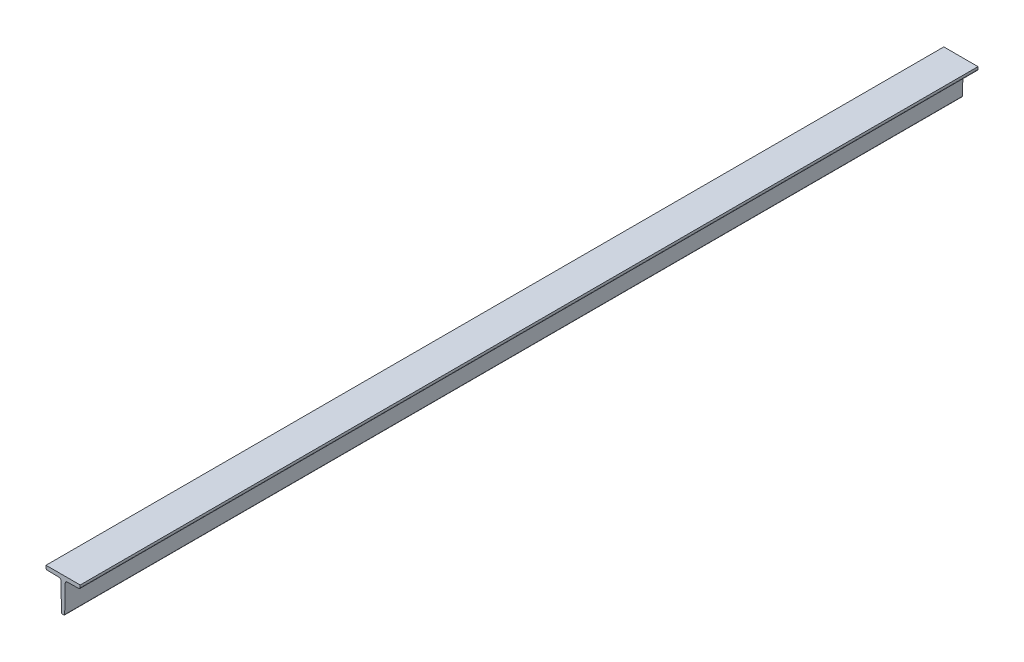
ISO-10303-21;
HEADER;
FILE_DESCRIPTION(('STEP AP214'),'2;1');
FILE_NAME('part.step','',(''),(''),'','','');
FILE_SCHEMA(('AUTOMOTIVE_DESIGN { 1 0 10303 214 1 1 1 1 }'));
ENDSEC;
DATA;
#1=APPLICATION_CONTEXT('core data for automotive mechanical design processes');
#2=APPLICATION_PROTOCOL_DEFINITION('international standard','automotive_design',2000,#1);
#3=PRODUCT_CONTEXT('',#1,'mechanical');
#4=PRODUCT('Part','Part','',(#3));
#5=PRODUCT_RELATED_PRODUCT_CATEGORY('part','',(#4));
#6=PRODUCT_DEFINITION_FORMATION('','',#4);
#7=PRODUCT_DEFINITION_CONTEXT('part definition',#1,'design');
#8=PRODUCT_DEFINITION('design','',#6,#7);
#9=PRODUCT_DEFINITION_SHAPE('','',#8);
#10=(LENGTH_UNIT() NAMED_UNIT(*) SI_UNIT(.MILLI.,.METRE.));
#11=(NAMED_UNIT(*) PLANE_ANGLE_UNIT() SI_UNIT($,.RADIAN.));
#12=(NAMED_UNIT(*) SI_UNIT($,.STERADIAN.) SOLID_ANGLE_UNIT());
#13=UNCERTAINTY_MEASURE_WITH_UNIT(LENGTH_MEASURE(1.E-05),#10,'distance_accuracy_value','');
#14=(GEOMETRIC_REPRESENTATION_CONTEXT(3) GLOBAL_UNCERTAINTY_ASSIGNED_CONTEXT((#13)) GLOBAL_UNIT_ASSIGNED_CONTEXT((#10,
#11,#12)) REPRESENTATION_CONTEXT('',''));
#15=CARTESIAN_POINT('',(0.,0.,0.));
#16=DIRECTION('',(0.,0.,1.));
#17=DIRECTION('',(1.,0.,0.));
#18=AXIS2_PLACEMENT_3D('',#15,#16,#17);
#19=CARTESIAN_POINT('',(-40.,0.,1051.));
#20=DIRECTION('',(1.,0.,0.));
#21=DIRECTION('',(0.,1.,0.));
#22=AXIS2_PLACEMENT_3D('',#19,#20,#21);
#23=PLANE('',#22);
#24=DIRECTION('',(0.,-1.,0.));
#25=VECTOR('',#24,1.);
#26=CARTESIAN_POINT('',(-40.,0.,-1051.));
#27=LINE('',#26,#25);
#28=CARTESIAN_POINT('',(-40.,0.,-1051.));
#29=VERTEX_POINT('',#28);
#30=CARTESIAN_POINT('',(-40.,-5.487795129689,-1051.));
#31=VERTEX_POINT('',#30);
#32=EDGE_CURVE('E137',#29,#31,#27,.T.);
#33=ORIENTED_EDGE('',*,*,#32,.T.);
#34=DIRECTION('',(0.,0.,-1.));
#35=VECTOR('',#34,1.);
#36=CARTESIAN_POINT('',(-40.,-5.487795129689,1051.));
#37=LINE('',#36,#35);
#38=CARTESIAN_POINT('',(-40.,-5.487795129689,1051.));
#39=VERTEX_POINT('',#38);
#40=EDGE_CURVE('E11',#39,#31,#37,.T.);
#41=ORIENTED_EDGE('',*,*,#40,.F.);
#42=DIRECTION('',(0.,-1.,0.));
#43=VECTOR('',#42,1.);
#44=CARTESIAN_POINT('',(-40.,0.,1051.));
#45=LINE('',#44,#43);
#46=CARTESIAN_POINT('',(-40.,0.,1051.));
#47=VERTEX_POINT('',#46);
#48=EDGE_CURVE('E176',#47,#39,#45,.T.);
#49=ORIENTED_EDGE('',*,*,#48,.F.);
#50=DIRECTION('',(0.,0.,-1.));
#51=VECTOR('',#50,1.);
#52=CARTESIAN_POINT('',(-40.,0.,1051.));
#53=LINE('',#52,#51);
#54=EDGE_CURVE('E150',#47,#29,#53,.T.);
#55=ORIENTED_EDGE('',*,*,#54,.T.);
#56=EDGE_LOOP('',(#33,#41,#49,#55));
#57=FACE_BOUND('',#56,.T.);
#58=ADVANCED_FACE('F33',(#57),#23,.F.);
#59=CARTESIAN_POINT('',(-36.825,-5.487795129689,1051.));
#60=DIRECTION('',(0.,0.,-1.));
#61=DIRECTION('',(-1.,0.,0.));
#62=AXIS2_PLACEMENT_3D('',#59,#60,#61);
#63=CYLINDRICAL_SURFACE('',#62,3.175);
#64=CARTESIAN_POINT('',(-36.825,-5.487795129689,-1051.));
#65=DIRECTION('',(0.,0.,1.));
#66=DIRECTION('',(-1.,0.,0.));
#67=AXIS2_PLACEMENT_3D('',#64,#65,#66);
#68=CIRCLE('',#67,3.175);
#69=CARTESIAN_POINT('',(-36.8885004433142,-8.66216005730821,-1051.));
#70=VERTEX_POINT('',#69);
#71=EDGE_CURVE('E133',#31,#70,#68,.T.);
#72=ORIENTED_EDGE('',*,*,#71,.T.);
#73=DIRECTION('',(0.,0.,-1.));
#74=VECTOR('',#73,1.);
#75=CARTESIAN_POINT('',(-36.8885004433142,-8.66216005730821,1051.));
#76=LINE('',#75,#74);
#77=CARTESIAN_POINT('',(-36.8885004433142,-8.66216005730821,1051.));
#78=VERTEX_POINT('',#77);
#79=EDGE_CURVE('E40',#78,#70,#76,.T.);
#80=ORIENTED_EDGE('',*,*,#79,.F.);
#81=CARTESIAN_POINT('',(-36.825,-5.487795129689,1051.));
#82=DIRECTION('',(0.,0.,1.));
#83=DIRECTION('',(-1.,0.,0.));
#84=AXIS2_PLACEMENT_3D('',#81,#82,#83);
#85=CIRCLE('',#84,3.175);
#86=EDGE_CURVE('E146',#39,#78,#85,.T.);
#87=ORIENTED_EDGE('',*,*,#86,.F.);
#88=ORIENTED_EDGE('',*,*,#40,.T.);
#89=EDGE_LOOP('',(#72,#80,#87,#88));
#90=FACE_BOUND('',#89,.T.);
#91=ADVANCED_FACE('F145',(#90),#63,.T.);
#92=CARTESIAN_POINT('',(-9.4368003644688,-9.21130773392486,1051.));
#93=DIRECTION('',(0.0200001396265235,0.9997999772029,0.));
#94=DIRECTION('',(-0.9997999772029,0.0200001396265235,0.));
#95=AXIS2_PLACEMENT_3D('',#92,#93,#94);
#96=PLANE('',#95);
#97=DIRECTION('',(0.9997999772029,-0.0200001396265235,0.));
#98=VECTOR('',#97,1.);
#99=CARTESIAN_POINT('',(-9.4368003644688,-9.21130773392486,-1051.));
#100=LINE('',#99,#98);
#101=CARTESIAN_POINT('',(-9.4368003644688,-9.21130773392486,-1051.));
#102=VERTEX_POINT('',#101);
#103=EDGE_CURVE('E139',#70,#102,#100,.T.);
#104=ORIENTED_EDGE('',*,*,#103,.T.);
#105=DIRECTION('',(0.,0.,-1.));
#106=VECTOR('',#105,1.);
#107=CARTESIAN_POINT('',(-9.4368003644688,-9.21130773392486,1051.));
#108=LINE('',#107,#106);
#109=CARTESIAN_POINT('',(-9.4368003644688,-9.21130773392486,1051.));
#110=VERTEX_POINT('',#109);
#111=EDGE_CURVE('E232',#110,#102,#108,.T.);
#112=ORIENTED_EDGE('',*,*,#111,.F.);
#113=DIRECTION('',(0.9997999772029,-0.0200001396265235,0.));
#114=VECTOR('',#113,1.);
#115=CARTESIAN_POINT('',(-9.4368003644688,-9.21130773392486,1051.));
#116=LINE('',#115,#114);
#117=EDGE_CURVE('E179',#78,#110,#116,.T.);
#118=ORIENTED_EDGE('',*,*,#117,.F.);
#119=ORIENTED_EDGE('',*,*,#79,.T.);
#120=EDGE_LOOP('',(#104,#112,#118,#119));
#121=FACE_BOUND('',#120,.T.);
#122=ADVANCED_FACE('F236',(#121),#96,.F.);
#123=CARTESIAN_POINT('',(-9.52680099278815,-13.7104076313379,1051.));
#124=DIRECTION('',(0.,0.,-1.));
#125=DIRECTION('',(-1.,0.,0.));
#126=AXIS2_PLACEMENT_3D('',#123,#124,#125);
#127=CYLINDRICAL_SURFACE('',#126,4.5);
#128=CARTESIAN_POINT('',(-9.52680099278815,-13.7104076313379,-1051.));
#129=DIRECTION('',(0.,0.,-1.));
#130=DIRECTION('',(1.,0.,0.));
#131=AXIS2_PLACEMENT_3D('',#128,#129,#130);
#132=CIRCLE('',#131,4.5);
#133=CARTESIAN_POINT('',(-5.0277010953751,-13.6204070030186,-1051.));
#134=VERTEX_POINT('',#133);
#135=EDGE_CURVE('E154',#102,#134,#132,.T.);
#136=ORIENTED_EDGE('',*,*,#135,.T.);
#137=DIRECTION('',(0.,0.,-1.));
#138=VECTOR('',#137,1.);
#139=CARTESIAN_POINT('',(-5.0277010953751,-13.6204070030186,1051.));
#140=LINE('',#139,#138);
#141=CARTESIAN_POINT('',(-5.0277010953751,-13.6204070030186,1051.));
#142=VERTEX_POINT('',#141);
#143=EDGE_CURVE('E229',#142,#134,#140,.T.);
#144=ORIENTED_EDGE('',*,*,#143,.F.);
#145=CARTESIAN_POINT('',(-9.52680099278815,-13.7104076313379,1051.));
#146=DIRECTION('',(0.,0.,-1.));
#147=DIRECTION('',(1.,0.,0.));
#148=AXIS2_PLACEMENT_3D('',#145,#146,#147);
#149=CIRCLE('',#148,4.5);
#150=EDGE_CURVE('E181',#110,#142,#149,.T.);
#151=ORIENTED_EDGE('',*,*,#150,.F.);
#152=ORIENTED_EDGE('',*,*,#111,.T.);
#153=EDGE_LOOP('',(#136,#144,#151,#152));
#154=FACE_BOUND('',#153,.T.);
#155=ADVANCED_FACE('F244',(#154),#127,.F.);
#156=CARTESIAN_POINT('',(-3.73904247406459,-78.0400002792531,1051.));
#157=DIRECTION('',(0.9997999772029,0.0200001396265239,0.));
#158=DIRECTION('',(-0.0200001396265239,0.9997999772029,0.));
#159=AXIS2_PLACEMENT_3D('',#156,#157,#158);
#160=PLANE('',#159);
#161=DIRECTION('',(0.0200001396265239,-0.9997999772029,0.));
#162=VECTOR('',#161,1.);
#163=CARTESIAN_POINT('',(-3.73904247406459,-78.0400002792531,-1051.));
#164=LINE('',#163,#162);
#165=CARTESIAN_POINT('',(-3.73904247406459,-78.0400002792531,-1051.));
#166=VERTEX_POINT('',#165);
#167=EDGE_CURVE('E156',#134,#166,#164,.T.);
#168=ORIENTED_EDGE('',*,*,#167,.T.);
#169=DIRECTION('',(0.,0.,-1.));
#170=VECTOR('',#169,1.);
#171=CARTESIAN_POINT('',(-3.73904247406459,-78.0400002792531,1051.));
#172=LINE('',#171,#170);
#173=CARTESIAN_POINT('',(-3.73904247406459,-78.0400002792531,1051.));
#174=VERTEX_POINT('',#173);
#175=EDGE_CURVE('E226',#174,#166,#172,.T.);
#176=ORIENTED_EDGE('',*,*,#175,.F.);
#177=DIRECTION('',(0.0200001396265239,-0.9997999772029,0.));
#178=VECTOR('',#177,1.);
#179=CARTESIAN_POINT('',(-3.73904247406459,-78.0400002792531,1051.));
#180=LINE('',#179,#178);
#181=EDGE_CURVE('E183',#142,#174,#180,.T.);
#182=ORIENTED_EDGE('',*,*,#181,.F.);
#183=ORIENTED_EDGE('',*,*,#143,.T.);
#184=EDGE_LOOP('',(#168,#176,#182,#183));
#185=FACE_BOUND('',#184,.T.);
#186=ADVANCED_FACE('F247',(#185),#160,.F.);
#187=CARTESIAN_POINT('',(-1.73944251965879,-78.,1051.));
#188=DIRECTION('',(0.,0.,-1.));
#189=DIRECTION('',(-1.,0.,0.));
#190=AXIS2_PLACEMENT_3D('',#187,#188,#189);
#191=CYLINDRICAL_SURFACE('',#190,2.);
#192=CARTESIAN_POINT('',(-1.73944251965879,-78.,-1051.));
#193=DIRECTION('',(0.,0.,1.));
#194=DIRECTION('',(-1.,0.,0.));
#195=AXIS2_PLACEMENT_3D('',#192,#193,#194);
#196=CIRCLE('',#195,2.);
#197=CARTESIAN_POINT('',(-1.73944251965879,-80.,-1051.));
#198=VERTEX_POINT('',#197);
#199=EDGE_CURVE('E158',#166,#198,#196,.T.);
#200=ORIENTED_EDGE('',*,*,#199,.T.);
#201=DIRECTION('',(0.,0.,-1.));
#202=VECTOR('',#201,1.);
#203=CARTESIAN_POINT('',(-1.73944251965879,-80.,1051.));
#204=LINE('',#203,#202);
#205=CARTESIAN_POINT('',(-1.73944251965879,-80.,1051.));
#206=VERTEX_POINT('',#205);
#207=EDGE_CURVE('E223',#206,#198,#204,.T.);
#208=ORIENTED_EDGE('',*,*,#207,.F.);
#209=CARTESIAN_POINT('',(-1.73944251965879,-78.,1051.));
#210=DIRECTION('',(0.,0.,1.));
#211=DIRECTION('',(-1.,0.,0.));
#212=AXIS2_PLACEMENT_3D('',#209,#210,#211);
#213=CIRCLE('',#212,2.);
#214=EDGE_CURVE('E185',#174,#206,#213,.T.);
#215=ORIENTED_EDGE('',*,*,#214,.F.);
#216=ORIENTED_EDGE('',*,*,#175,.T.);
#217=EDGE_LOOP('',(#200,#208,#215,#216));
#218=FACE_BOUND('',#217,.T.);
#219=ADVANCED_FACE('F252',(#218),#191,.T.);
#220=CARTESIAN_POINT('',(-1.73944251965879,-80.,1051.));
#221=DIRECTION('',(0.,1.,0.));
#222=DIRECTION('',(0.,0.,1.));
#223=AXIS2_PLACEMENT_3D('',#220,#221,#222);
#224=PLANE('',#223);
#225=DIRECTION('',(1.,0.,0.));
#226=VECTOR('',#225,1.);
#227=CARTESIAN_POINT('',(-1.73944251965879,-80.,-1051.));
#228=LINE('',#227,#226);
#229=CARTESIAN_POINT('',(1.73944251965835,-80.,-1051.));
#230=VERTEX_POINT('',#229);
#231=EDGE_CURVE('E160',#198,#230,#228,.T.);
#232=ORIENTED_EDGE('',*,*,#231,.T.);
#233=DIRECTION('',(0.,0.,-1.));
#234=VECTOR('',#233,1.);
#235=CARTESIAN_POINT('',(1.73944251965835,-80.,1051.));
#236=LINE('',#235,#234);
#237=CARTESIAN_POINT('',(1.73944251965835,-80.,1051.));
#238=VERTEX_POINT('',#237);
#239=EDGE_CURVE('E220',#238,#230,#236,.T.);
#240=ORIENTED_EDGE('',*,*,#239,.F.);
#241=DIRECTION('',(1.,0.,0.));
#242=VECTOR('',#241,1.);
#243=CARTESIAN_POINT('',(-1.73944251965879,-80.,1051.));
#244=LINE('',#243,#242);
#245=EDGE_CURVE('E187',#206,#238,#244,.T.);
#246=ORIENTED_EDGE('',*,*,#245,.F.);
#247=ORIENTED_EDGE('',*,*,#207,.T.);
#248=EDGE_LOOP('',(#232,#240,#246,#247));
#249=FACE_BOUND('',#248,.T.);
#250=ADVANCED_FACE('F258',(#249),#224,.F.);
#251=CARTESIAN_POINT('',(1.73944251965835,-78.,1051.));
#252=DIRECTION('',(0.,0.,-1.));
#253=DIRECTION('',(-1.,0.,0.));
#254=AXIS2_PLACEMENT_3D('',#251,#252,#253);
#255=CYLINDRICAL_SURFACE('',#254,2.);
#256=CARTESIAN_POINT('',(1.73944251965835,-78.,-1051.));
#257=DIRECTION('',(0.,0.,1.));
#258=DIRECTION('',(-1.,0.,0.));
#259=AXIS2_PLACEMENT_3D('',#256,#257,#258);
#260=CIRCLE('',#259,2.);
#261=CARTESIAN_POINT('',(3.73904247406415,-78.0400002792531,-1051.));
#262=VERTEX_POINT('',#261);
#263=EDGE_CURVE('E162',#230,#262,#260,.T.);
#264=ORIENTED_EDGE('',*,*,#263,.T.);
#265=DIRECTION('',(0.,0.,-1.));
#266=VECTOR('',#265,1.);
#267=CARTESIAN_POINT('',(3.73904247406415,-78.0400002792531,1051.));
#268=LINE('',#267,#266);
#269=CARTESIAN_POINT('',(3.73904247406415,-78.0400002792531,1051.));
#270=VERTEX_POINT('',#269);
#271=EDGE_CURVE('E217',#270,#262,#268,.T.);
#272=ORIENTED_EDGE('',*,*,#271,.F.);
#273=CARTESIAN_POINT('',(1.73944251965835,-78.,1051.));
#274=DIRECTION('',(0.,0.,1.));
#275=DIRECTION('',(-1.,0.,0.));
#276=AXIS2_PLACEMENT_3D('',#273,#274,#275);
#277=CIRCLE('',#276,2.);
#278=EDGE_CURVE('E189',#238,#270,#277,.T.);
#279=ORIENTED_EDGE('',*,*,#278,.F.);
#280=ORIENTED_EDGE('',*,*,#239,.T.);
#281=EDGE_LOOP('',(#264,#272,#279,#280));
#282=FACE_BOUND('',#281,.T.);
#283=ADVANCED_FACE('F262',(#282),#255,.T.);
#284=CARTESIAN_POINT('',(5.0277010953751,-13.6204070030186,1051.));
#285=DIRECTION('',(-0.9997999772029,0.0200001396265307,0.));
#286=DIRECTION('',(-0.0200001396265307,-0.9997999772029,0.));
#287=AXIS2_PLACEMENT_3D('',#284,#285,#286);
#288=PLANE('',#287);
#289=DIRECTION('',(0.0200001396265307,0.9997999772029,0.));
#290=VECTOR('',#289,1.);
#291=CARTESIAN_POINT('',(5.0277010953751,-13.6204070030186,-1051.));
#292=LINE('',#291,#290);
#293=CARTESIAN_POINT('',(5.0277010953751,-13.6204070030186,-1051.));
#294=VERTEX_POINT('',#293);
#295=EDGE_CURVE('E164',#262,#294,#292,.T.);
#296=ORIENTED_EDGE('',*,*,#295,.T.);
#297=DIRECTION('',(0.,0.,-1.));
#298=VECTOR('',#297,1.);
#299=CARTESIAN_POINT('',(5.0277010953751,-13.6204070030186,1051.));
#300=LINE('',#299,#298);
#301=CARTESIAN_POINT('',(5.0277010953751,-13.6204070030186,1051.));
#302=VERTEX_POINT('',#301);
#303=EDGE_CURVE('E214',#302,#294,#300,.T.);
#304=ORIENTED_EDGE('',*,*,#303,.F.);
#305=DIRECTION('',(0.0200001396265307,0.9997999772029,0.));
#306=VECTOR('',#305,1.);
#307=CARTESIAN_POINT('',(5.0277010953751,-13.6204070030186,1051.));
#308=LINE('',#307,#306);
#309=EDGE_CURVE('E191',#270,#302,#308,.T.);
#310=ORIENTED_EDGE('',*,*,#309,.F.);
#311=ORIENTED_EDGE('',*,*,#271,.T.);
#312=EDGE_LOOP('',(#296,#304,#310,#311));
#313=FACE_BOUND('',#312,.T.);
#314=ADVANCED_FACE('F267',(#313),#288,.F.);
#315=CARTESIAN_POINT('',(9.52680099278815,-13.710407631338,1051.));
#316=DIRECTION('',(0.,0.,-1.));
#317=DIRECTION('',(-1.,0.,0.));
#318=AXIS2_PLACEMENT_3D('',#315,#316,#317);
#319=CYLINDRICAL_SURFACE('',#318,4.5);
#320=CARTESIAN_POINT('',(9.52680099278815,-13.710407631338,-1051.));
#321=DIRECTION('',(0.,0.,-1.));
#322=DIRECTION('',(1.,0.,0.));
#323=AXIS2_PLACEMENT_3D('',#320,#321,#322);
#324=CIRCLE('',#323,4.5);
#325=CARTESIAN_POINT('',(9.43680036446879,-9.21130773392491,-1051.));
#326=VERTEX_POINT('',#325);
#327=EDGE_CURVE('E166',#294,#326,#324,.T.);
#328=ORIENTED_EDGE('',*,*,#327,.T.);
#329=DIRECTION('',(0.,0.,-1.));
#330=VECTOR('',#329,1.);
#331=CARTESIAN_POINT('',(9.43680036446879,-9.21130773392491,1051.));
#332=LINE('',#331,#330);
#333=CARTESIAN_POINT('',(9.43680036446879,-9.21130773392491,1051.));
#334=VERTEX_POINT('',#333);
#335=EDGE_CURVE('E211',#334,#326,#332,.T.);
#336=ORIENTED_EDGE('',*,*,#335,.F.);
#337=CARTESIAN_POINT('',(9.52680099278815,-13.710407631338,1051.));
#338=DIRECTION('',(0.,0.,-1.));
#339=DIRECTION('',(1.,0.,0.));
#340=AXIS2_PLACEMENT_3D('',#337,#338,#339);
#341=CIRCLE('',#340,4.5);
#342=EDGE_CURVE('E193',#302,#334,#341,.T.);
#343=ORIENTED_EDGE('',*,*,#342,.F.);
#344=ORIENTED_EDGE('',*,*,#303,.T.);
#345=EDGE_LOOP('',(#328,#336,#343,#344));
#346=FACE_BOUND('',#345,.T.);
#347=ADVANCED_FACE('F273',(#346),#319,.F.);
#348=CARTESIAN_POINT('',(36.8885004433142,-8.66216005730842,1051.));
#349=DIRECTION('',(-0.0200001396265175,0.9997999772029,0.));
#350=DIRECTION('',(-0.9997999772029,-0.0200001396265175,0.));
#351=AXIS2_PLACEMENT_3D('',#348,#349,#350);
#352=PLANE('',#351);
#353=DIRECTION('',(0.9997999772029,0.0200001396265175,0.));
#354=VECTOR('',#353,1.);
#355=CARTESIAN_POINT('',(36.8885004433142,-8.66216005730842,-1051.));
#356=LINE('',#355,#354);
#357=CARTESIAN_POINT('',(36.8885004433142,-8.66216005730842,-1051.));
#358=VERTEX_POINT('',#357);
#359=EDGE_CURVE('E168',#326,#358,#356,.T.);
#360=ORIENTED_EDGE('',*,*,#359,.T.);
#361=DIRECTION('',(0.,0.,-1.));
#362=VECTOR('',#361,1.);
#363=CARTESIAN_POINT('',(36.8885004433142,-8.66216005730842,1051.));
#364=LINE('',#363,#362);
#365=CARTESIAN_POINT('',(36.8885004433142,-8.66216005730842,1051.));
#366=VERTEX_POINT('',#365);
#367=EDGE_CURVE('E208',#366,#358,#364,.T.);
#368=ORIENTED_EDGE('',*,*,#367,.F.);
#369=DIRECTION('',(0.9997999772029,0.0200001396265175,0.));
#370=VECTOR('',#369,1.);
#371=CARTESIAN_POINT('',(36.8885004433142,-8.66216005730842,1051.));
#372=LINE('',#371,#370);
#373=EDGE_CURVE('E195',#334,#366,#372,.T.);
#374=ORIENTED_EDGE('',*,*,#373,.F.);
#375=ORIENTED_EDGE('',*,*,#335,.T.);
#376=EDGE_LOOP('',(#360,#368,#374,#375));
#377=FACE_BOUND('',#376,.T.);
#378=ADVANCED_FACE('F277',(#377),#352,.F.);
#379=CARTESIAN_POINT('',(36.825,-5.48779512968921,1051.));
#380=DIRECTION('',(0.,0.,-1.));
#381=DIRECTION('',(-1.,0.,0.));
#382=AXIS2_PLACEMENT_3D('',#379,#380,#381);
#383=CYLINDRICAL_SURFACE('',#382,3.175);
#384=CARTESIAN_POINT('',(36.825,-5.48779512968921,-1051.));
#385=DIRECTION('',(0.,0.,1.));
#386=DIRECTION('',(1.,0.,0.));
#387=AXIS2_PLACEMENT_3D('',#384,#385,#386);
#388=CIRCLE('',#387,3.175);
#389=CARTESIAN_POINT('',(40.,-5.48779512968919,-1051.));
#390=VERTEX_POINT('',#389);
#391=EDGE_CURVE('E170',#358,#390,#388,.T.);
#392=ORIENTED_EDGE('',*,*,#391,.T.);
#393=DIRECTION('',(0.,0.,-1.));
#394=VECTOR('',#393,1.);
#395=CARTESIAN_POINT('',(40.,-5.48779512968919,1051.));
#396=LINE('',#395,#394);
#397=CARTESIAN_POINT('',(40.,-5.48779512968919,1051.));
#398=VERTEX_POINT('',#397);
#399=EDGE_CURVE('E205',#398,#390,#396,.T.);
#400=ORIENTED_EDGE('',*,*,#399,.F.);
#401=CARTESIAN_POINT('',(36.825,-5.48779512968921,1051.));
#402=DIRECTION('',(0.,0.,1.));
#403=DIRECTION('',(1.,0.,0.));
#404=AXIS2_PLACEMENT_3D('',#401,#402,#403);
#405=CIRCLE('',#404,3.175);
#406=EDGE_CURVE('E197',#366,#398,#405,.T.);
#407=ORIENTED_EDGE('',*,*,#406,.F.);
#408=ORIENTED_EDGE('',*,*,#367,.T.);
#409=EDGE_LOOP('',(#392,#400,#407,#408));
#410=FACE_BOUND('',#409,.T.);
#411=ADVANCED_FACE('F282',(#410),#383,.T.);
#412=CARTESIAN_POINT('',(40.,0.,1051.));
#413=DIRECTION('',(-1.,0.,0.));
#414=DIRECTION('',(0.,-1.,0.));
#415=AXIS2_PLACEMENT_3D('',#412,#413,#414);
#416=PLANE('',#415);
#417=DIRECTION('',(0.,1.,0.));
#418=VECTOR('',#417,1.);
#419=CARTESIAN_POINT('',(40.,0.,-1051.));
#420=LINE('',#419,#418);
#421=CARTESIAN_POINT('',(40.,0.,-1051.));
#422=VERTEX_POINT('',#421);
#423=EDGE_CURVE('E172',#390,#422,#420,.T.);
#424=ORIENTED_EDGE('',*,*,#423,.T.);
#425=DIRECTION('',(0.,0.,-1.));
#426=VECTOR('',#425,1.);
#427=CARTESIAN_POINT('',(40.,0.,1051.));
#428=LINE('',#427,#426);
#429=CARTESIAN_POINT('',(40.,0.,1051.));
#430=VERTEX_POINT('',#429);
#431=EDGE_CURVE('E202',#430,#422,#428,.T.);
#432=ORIENTED_EDGE('',*,*,#431,.F.);
#433=DIRECTION('',(0.,1.,0.));
#434=VECTOR('',#433,1.);
#435=CARTESIAN_POINT('',(40.,0.,1051.));
#436=LINE('',#435,#434);
#437=EDGE_CURVE('E52',#398,#430,#436,.T.);
#438=ORIENTED_EDGE('',*,*,#437,.F.);
#439=ORIENTED_EDGE('',*,*,#399,.T.);
#440=EDGE_LOOP('',(#424,#432,#438,#439));
#441=FACE_BOUND('',#440,.T.);
#442=ADVANCED_FACE('F285',(#441),#416,.F.);
#443=CARTESIAN_POINT('',(-40.,0.,1051.));
#444=DIRECTION('',(0.,-1.,0.));
#445=DIRECTION('',(1.,0.,0.));
#446=AXIS2_PLACEMENT_3D('',#443,#444,#445);
#447=PLANE('',#446);
#448=DIRECTION('',(-1.,0.,0.));
#449=VECTOR('',#448,1.);
#450=CARTESIAN_POINT('',(-40.,0.,-1051.));
#451=LINE('',#450,#449);
#452=EDGE_CURVE('E174',#422,#29,#451,.T.);
#453=ORIENTED_EDGE('',*,*,#452,.T.);
#454=ORIENTED_EDGE('',*,*,#54,.F.);
#455=DIRECTION('',(-1.,0.,0.));
#456=VECTOR('',#455,1.);
#457=CARTESIAN_POINT('',(-40.,0.,1051.));
#458=LINE('',#457,#456);
#459=EDGE_CURVE('E47',#430,#47,#458,.T.);
#460=ORIENTED_EDGE('',*,*,#459,.F.);
#461=ORIENTED_EDGE('',*,*,#431,.T.);
#462=EDGE_LOOP('',(#453,#454,#460,#461));
#463=FACE_BOUND('',#462,.T.);
#464=ADVANCED_FACE('F287',(#463),#447,.F.);
#465=CARTESIAN_POINT('',(-36.825,-5.487795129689,1051.));
#466=DIRECTION('',(0.,0.,-1.));
#467=DIRECTION('',(-1.,0.,0.));
#468=AXIS2_PLACEMENT_3D('',#465,#466,#467);
#469=PLANE('',#468);
#470=ORIENTED_EDGE('',*,*,#48,.T.);
#471=ORIENTED_EDGE('',*,*,#86,.T.);
#472=ORIENTED_EDGE('',*,*,#117,.T.);
#473=ORIENTED_EDGE('',*,*,#150,.T.);
#474=ORIENTED_EDGE('',*,*,#181,.T.);
#475=ORIENTED_EDGE('',*,*,#214,.T.);
#476=ORIENTED_EDGE('',*,*,#245,.T.);
#477=ORIENTED_EDGE('',*,*,#278,.T.);
#478=ORIENTED_EDGE('',*,*,#309,.T.);
#479=ORIENTED_EDGE('',*,*,#342,.T.);
#480=ORIENTED_EDGE('',*,*,#373,.T.);
#481=ORIENTED_EDGE('',*,*,#406,.T.);
#482=ORIENTED_EDGE('',*,*,#437,.T.);
#483=ORIENTED_EDGE('',*,*,#459,.T.);
#484=EDGE_LOOP('',(#470,#471,#472,#473,#474,#475,#476,#477,#478,#479,#480,#481,#482,#483));
#485=FACE_BOUND('',#484,.T.);
#486=ADVANCED_FACE('F239',(#485),#469,.F.);
#487=CARTESIAN_POINT('',(-36.825,-5.487795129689,-1051.));
#488=DIRECTION('',(0.,0.,-1.));
#489=DIRECTION('',(-1.,0.,0.));
#490=AXIS2_PLACEMENT_3D('',#487,#488,#489);
#491=PLANE('',#490);
#492=ORIENTED_EDGE('',*,*,#32,.F.);
#493=ORIENTED_EDGE('',*,*,#452,.F.);
#494=ORIENTED_EDGE('',*,*,#423,.F.);
#495=ORIENTED_EDGE('',*,*,#391,.F.);
#496=ORIENTED_EDGE('',*,*,#359,.F.);
#497=ORIENTED_EDGE('',*,*,#327,.F.);
#498=ORIENTED_EDGE('',*,*,#295,.F.);
#499=ORIENTED_EDGE('',*,*,#263,.F.);
#500=ORIENTED_EDGE('',*,*,#231,.F.);
#501=ORIENTED_EDGE('',*,*,#199,.F.);
#502=ORIENTED_EDGE('',*,*,#167,.F.);
#503=ORIENTED_EDGE('',*,*,#135,.F.);
#504=ORIENTED_EDGE('',*,*,#103,.F.);
#505=ORIENTED_EDGE('',*,*,#71,.F.);
#506=EDGE_LOOP('',(#492,#493,#494,#495,#496,#497,#498,#499,#500,#501,#502,#503,#504,#505));
#507=FACE_BOUND('',#506,.T.);
#508=ADVANCED_FACE('F134',(#507),#491,.T.);
#509=CLOSED_SHELL('',(#58,#91,#122,#155,#186,#219,#250,#283,#314,#347,#378,#411,#442,#464,#486,#508));
#510=MANIFOLD_SOLID_BREP('B2',#509);
#511=ADVANCED_BREP_SHAPE_REPRESENTATION('',(#18,#510),#14);
#512=SHAPE_DEFINITION_REPRESENTATION(#9,#511);
ENDSEC;
END-ISO-10303-21;
